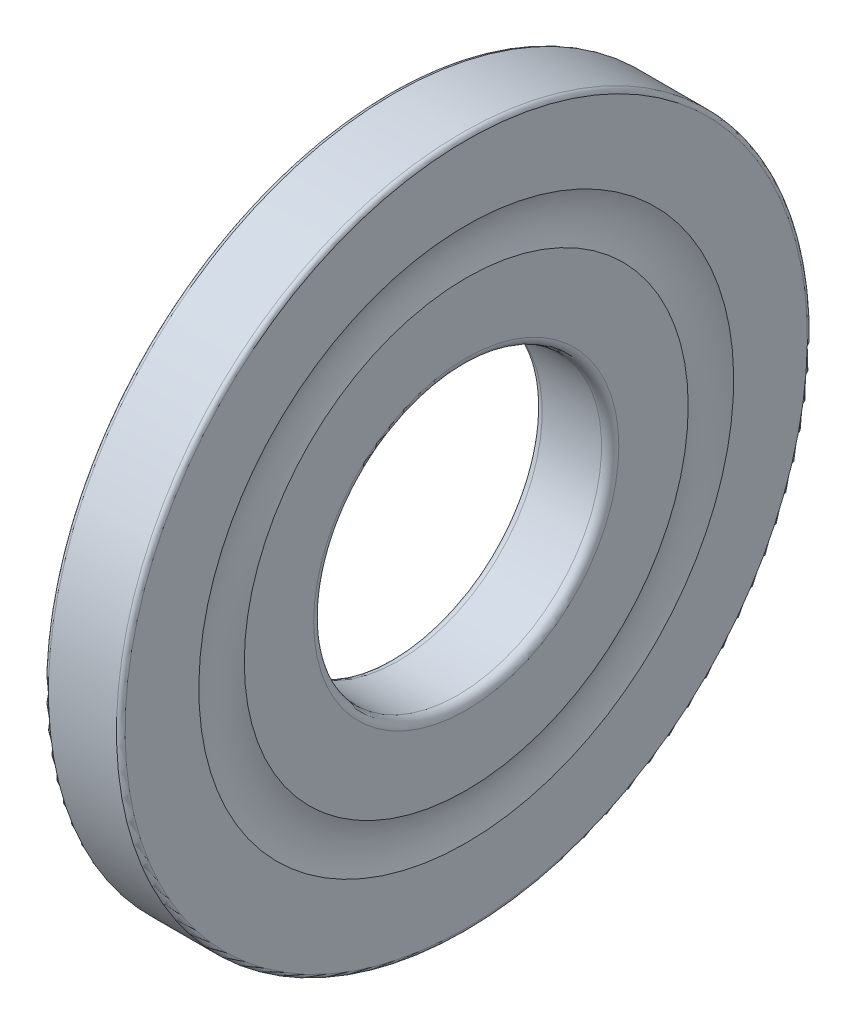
from build123d import *


with BuildPart() as part:
    # Esquisse1 → R_volution1 (revolve)
    with BuildSketch(Plane.XY, mode=Mode.PRIVATE) as r_volution1_sk:
        with BuildLine():
            Line((-1.8375, 9.289679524), (-1.8375, 11.85))
            ThreePointArc((-1.8375, 11.85), (-1.881433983, 11.956066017), (-1.9875, 12))
            Line((-1.9875, 12), (-4.35, 12))
            ThreePointArc((-4.35, 12), (-4.456066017, 11.956066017), (-4.5, 11.85))
            Line((-4.5, 11.85), (-4.5, 5.3))
            ThreePointArc((-4.5, 5.3), (-4.412132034, 5.087867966), (-4.2, 5))
            Line((-4.2, 5), (-2.1375, 5))
            ThreePointArc((-2.1375, 5), (-1.925367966, 5.087867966), (-1.8375, 5.3))
            Line((-1.8375, 5.3), (-1.8375, 7.710320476))
            ThreePointArc((-1.8375, 7.710320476), (-2, 8.5), (-1.8375, 9.289679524))
        make_face()
    revolve(r_volution1_sk.sketch.rotate(Axis((-4.5, 0, 0), (1, 0, 0)), 180), axis=Axis((-4.5, 0, 0), (1, 0, 0)))


solid = part.part
